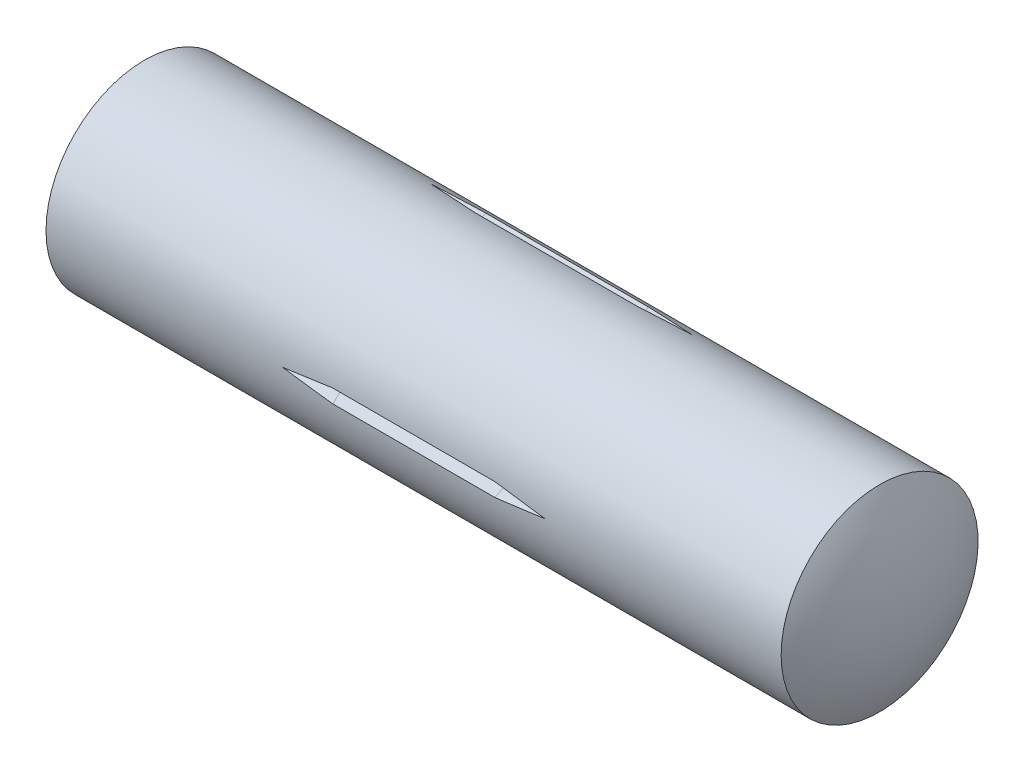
ISO-10303-21;
HEADER;
FILE_DESCRIPTION(('STEP AP214'),'2;1');
FILE_NAME('part.step','',(''),(''),'','','');
FILE_SCHEMA(('AUTOMOTIVE_DESIGN { 1 0 10303 214 1 1 1 1 }'));
ENDSEC;
DATA;
#1=APPLICATION_CONTEXT('core data for automotive mechanical design processes');
#2=APPLICATION_PROTOCOL_DEFINITION('international standard','automotive_design',2000,#1);
#3=PRODUCT_CONTEXT('',#1,'mechanical');
#4=PRODUCT('Part','Part','',(#3));
#5=PRODUCT_RELATED_PRODUCT_CATEGORY('part','',(#4));
#6=PRODUCT_DEFINITION_FORMATION('','',#4);
#7=PRODUCT_DEFINITION_CONTEXT('part definition',#1,'design');
#8=PRODUCT_DEFINITION('design','',#6,#7);
#9=PRODUCT_DEFINITION_SHAPE('','',#8);
#10=(LENGTH_UNIT() NAMED_UNIT(*) SI_UNIT(.MILLI.,.METRE.));
#11=(NAMED_UNIT(*) PLANE_ANGLE_UNIT() SI_UNIT($,.RADIAN.));
#12=(NAMED_UNIT(*) SI_UNIT($,.STERADIAN.) SOLID_ANGLE_UNIT());
#13=UNCERTAINTY_MEASURE_WITH_UNIT(LENGTH_MEASURE(1.E-05),#10,'distance_accuracy_value','');
#14=(GEOMETRIC_REPRESENTATION_CONTEXT(3) GLOBAL_UNCERTAINTY_ASSIGNED_CONTEXT((#13)) GLOBAL_UNIT_ASSIGNED_CONTEXT((#10,
#11,#12)) REPRESENTATION_CONTEXT('',''));
#15=CARTESIAN_POINT('',(0.,0.,0.));
#16=DIRECTION('',(0.,0.,1.));
#17=DIRECTION('',(1.,0.,0.));
#18=AXIS2_PLACEMENT_3D('',#15,#16,#17);
#19=CARTESIAN_POINT('',(-57.,0.,0.));
#20=DIRECTION('',(-1.,0.,0.));
#21=DIRECTION('',(0.,0.,1.));
#22=AXIS2_PLACEMENT_3D('',#19,#20,#21);
#23=CYLINDRICAL_SURFACE('',#22,12.5);
#24=CARTESIAN_POINT('',(-45.8333333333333,0.,0.));
#25=DIRECTION('',(-0.113967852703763,-0.0865878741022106,-0.989703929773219));
#26=DIRECTION('',(-0.993484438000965,0.00993295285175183,0.11353417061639));
#27=AXIS2_PLACEMENT_3D('',#24,#25,#26);
#28=ELLIPSE('',#27,109.68005190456,12.5);
#29=CARTESIAN_POINT('',(16.6666666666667,-10.8253175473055,-6.25000000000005));
#30=VERTEX_POINT('',#29);
#31=CARTESIAN_POINT('',(10.2959000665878,-11.2344625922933,-5.48058849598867));
#32=VERTEX_POINT('',#31);
#33=EDGE_CURVE('E230',#30,#32,#28,.T.);
#34=ORIENTED_EDGE('',*,*,#33,.F.);
#35=CARTESIAN_POINT('',(-45.8333333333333,0.,0.));
#36=DIRECTION('',(-0.113967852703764,-0.900402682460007,0.419864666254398));
#37=DIRECTION('',(-0.993484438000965,0.103289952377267,-0.0481648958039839));
#38=AXIS2_PLACEMENT_3D('',#35,#36,#37);
#39=ELLIPSE('',#38,109.68005190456,12.5);
#40=CARTESIAN_POINT('',(10.2959000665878,-10.3635601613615,-6.9890357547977));
#41=VERTEX_POINT('',#40);
#42=EDGE_CURVE('E228',#41,#30,#39,.T.);
#43=ORIENTED_EDGE('',*,*,#42,.F.);
#44=DIRECTION('',(-1.,0.,0.));
#45=VECTOR('',#44,1.);
#46=CARTESIAN_POINT('',(-57.,-10.3635601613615,-6.9890357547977));
#47=LINE('',#46,#45);
#48=CARTESIAN_POINT('',(-10.2959000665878,-10.3635601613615,-6.98903575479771));
#49=VERTEX_POINT('',#48);
#50=EDGE_CURVE('E222',#41,#49,#47,.T.);
#51=ORIENTED_EDGE('',*,*,#50,.T.);
#52=CARTESIAN_POINT('',(45.8333333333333,0.,0.));
#53=DIRECTION('',(0.113967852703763,-0.900402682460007,0.419864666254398));
#54=DIRECTION('',(-0.993484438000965,-0.103289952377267,0.0481648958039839));
#55=AXIS2_PLACEMENT_3D('',#52,#53,#54);
#56=ELLIPSE('',#55,109.68005190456,12.5);
#57=CARTESIAN_POINT('',(-16.6666666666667,-10.8253175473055,-6.25000000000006));
#58=VERTEX_POINT('',#57);
#59=EDGE_CURVE('E218',#58,#49,#56,.T.);
#60=ORIENTED_EDGE('',*,*,#59,.F.);
#61=CARTESIAN_POINT('',(45.8333333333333,0.,0.));
#62=DIRECTION('',(0.113967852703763,-0.0865878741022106,-0.989703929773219));
#63=DIRECTION('',(-0.993484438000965,-0.00993295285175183,-0.11353417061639));
#64=AXIS2_PLACEMENT_3D('',#61,#62,#63);
#65=ELLIPSE('',#64,109.68005190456,12.5);
#66=CARTESIAN_POINT('',(-10.2959000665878,-11.2344625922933,-5.48058849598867));
#67=VERTEX_POINT('',#66);
#68=EDGE_CURVE('E220',#67,#58,#65,.T.);
#69=ORIENTED_EDGE('',*,*,#68,.F.);
#70=DIRECTION('',(-1.,0.,0.));
#71=VECTOR('',#70,1.);
#72=CARTESIAN_POINT('',(-57.,-11.2344625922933,-5.48058849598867));
#73=LINE('',#72,#71);
#74=EDGE_CURVE('E225',#67,#32,#73,.F.);
#75=ORIENTED_EDGE('',*,*,#74,.T.);
#76=EDGE_LOOP('',(#34,#43,#51,#60,#69,#75));
#77=FACE_BOUND('',#76,.T.);
#78=CARTESIAN_POINT('',(46.6506350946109,0.,0.));
#79=DIRECTION('',(-1.,0.,0.));
#80=DIRECTION('',(0.,0.,1.));
#81=AXIS2_PLACEMENT_3D('',#78,#79,#80);
#82=CIRCLE('',#81,12.5);
#83=CARTESIAN_POINT('',(46.6506350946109,0.,12.5));
#84=VERTEX_POINT('',#83);
#85=EDGE_CURVE('E197',#84,#84,#82,.T.);
#86=ORIENTED_EDGE('',*,*,#85,.T.);
#87=EDGE_LOOP('',(#86));
#88=FACE_BOUND('',#87,.T.);
#89=CARTESIAN_POINT('',(-46.6819046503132,0.,0.));
#90=DIRECTION('',(-1.,0.,0.));
#91=DIRECTION('',(0.,0.,1.));
#92=AXIS2_PLACEMENT_3D('',#89,#90,#91);
#93=CIRCLE('',#92,12.5);
#94=CARTESIAN_POINT('',(-46.6819046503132,12.5,0.));
#95=VERTEX_POINT('',#94);
#96=EDGE_CURVE('E194',#95,#95,#93,.T.);
#97=ORIENTED_EDGE('',*,*,#96,.F.);
#98=EDGE_LOOP('',(#97));
#99=FACE_BOUND('',#98,.T.);
#100=CARTESIAN_POINT('',(-45.8333333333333,0.,0.));
#101=DIRECTION('',(-0.113967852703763,-0.81381480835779,0.569839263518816));
#102=DIRECTION('',(-0.993484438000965,0.0933569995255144,-0.0653692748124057));
#103=AXIS2_PLACEMENT_3D('',#100,#101,#102);
#104=ELLIPSE('',#103,109.68005190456,12.5);
#105=CARTESIAN_POINT('',(16.6666666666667,0.,12.5));
#106=VERTEX_POINT('',#105);
#107=CARTESIAN_POINT('',(10.2959000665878,0.870902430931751,12.4696242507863));
#108=VERTEX_POINT('',#107);
#109=EDGE_CURVE('E216',#106,#108,#104,.T.);
#110=ORIENTED_EDGE('',*,*,#109,.F.);
#111=CARTESIAN_POINT('',(-45.8333333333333,0.,0.));
#112=DIRECTION('',(-0.113967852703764,0.813814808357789,0.569839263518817));
#113=DIRECTION('',(-0.993484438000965,-0.0933569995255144,-0.0653692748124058));
#114=AXIS2_PLACEMENT_3D('',#111,#112,#113);
#115=ELLIPSE('',#114,109.68005190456,12.5);
#116=CARTESIAN_POINT('',(10.2959000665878,-0.870902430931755,12.4696242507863));
#117=VERTEX_POINT('',#116);
#118=EDGE_CURVE('E214',#117,#106,#115,.T.);
#119=ORIENTED_EDGE('',*,*,#118,.F.);
#120=DIRECTION('',(-1.,0.,0.));
#121=VECTOR('',#120,1.);
#122=CARTESIAN_POINT('',(-57.,-0.870902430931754,12.4696242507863));
#123=LINE('',#122,#121);
#124=CARTESIAN_POINT('',(-10.2959000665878,-0.870902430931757,12.4696242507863));
#125=VERTEX_POINT('',#124);
#126=EDGE_CURVE('E208',#117,#125,#123,.T.);
#127=ORIENTED_EDGE('',*,*,#126,.T.);
#128=CARTESIAN_POINT('',(45.8333333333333,0.,0.));
#129=DIRECTION('',(0.113967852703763,0.813814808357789,0.569839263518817));
#130=DIRECTION('',(-0.993484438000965,0.0933569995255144,0.0653692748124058));
#131=AXIS2_PLACEMENT_3D('',#128,#129,#130);
#132=ELLIPSE('',#131,109.68005190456,12.5);
#133=CARTESIAN_POINT('',(-16.6666666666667,0.,12.5));
#134=VERTEX_POINT('',#133);
#135=EDGE_CURVE('E203',#134,#125,#132,.T.);
#136=ORIENTED_EDGE('',*,*,#135,.F.);
#137=CARTESIAN_POINT('',(45.8333333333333,0.,0.));
#138=DIRECTION('',(0.113967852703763,-0.81381480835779,0.569839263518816));
#139=DIRECTION('',(-0.993484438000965,-0.0933569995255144,0.0653692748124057));
#140=AXIS2_PLACEMENT_3D('',#137,#138,#139);
#141=ELLIPSE('',#140,109.68005190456,12.5);
#142=CARTESIAN_POINT('',(-10.2959000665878,0.870902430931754,12.4696242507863));
#143=VERTEX_POINT('',#142);
#144=EDGE_CURVE('E205',#143,#134,#141,.T.);
#145=ORIENTED_EDGE('',*,*,#144,.F.);
#146=DIRECTION('',(-1.,0.,0.));
#147=VECTOR('',#146,1.);
#148=CARTESIAN_POINT('',(-57.,0.87090243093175,12.4696242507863));
#149=LINE('',#148,#147);
#150=EDGE_CURVE('E211',#143,#108,#149,.F.);
#151=ORIENTED_EDGE('',*,*,#150,.T.);
#152=EDGE_LOOP('',(#110,#119,#127,#136,#145,#151));
#153=FACE_BOUND('',#152,.T.);
#154=CARTESIAN_POINT('',(-45.8333333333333,0.,0.));
#155=DIRECTION('',(-0.113967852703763,0.900402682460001,0.419864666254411));
#156=DIRECTION('',(-0.993484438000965,-0.103289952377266,-0.0481648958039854));
#157=AXIS2_PLACEMENT_3D('',#154,#155,#156);
#158=ELLIPSE('',#157,109.68005190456,12.5);
#159=CARTESIAN_POINT('',(16.6666666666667,10.8253175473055,-6.2499999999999));
#160=VERTEX_POINT('',#159);
#161=CARTESIAN_POINT('',(10.2959000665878,10.3635601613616,-6.98903575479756));
#162=VERTEX_POINT('',#161);
#163=EDGE_CURVE('E12',#160,#162,#158,.T.);
#164=ORIENTED_EDGE('',*,*,#163,.F.);
#165=CARTESIAN_POINT('',(-45.8333333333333,0.,0.));
#166=DIRECTION('',(-0.113967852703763,0.086587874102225,-0.989703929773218));
#167=DIRECTION('',(-0.993484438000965,-0.00993295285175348,0.11353417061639));
#168=AXIS2_PLACEMENT_3D('',#165,#166,#167);
#169=ELLIPSE('',#168,109.68005190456,12.5);
#170=CARTESIAN_POINT('',(10.2959000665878,11.2344625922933,-5.48058849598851));
#171=VERTEX_POINT('',#170);
#172=EDGE_CURVE('E46',#171,#160,#169,.T.);
#173=ORIENTED_EDGE('',*,*,#172,.F.);
#174=DIRECTION('',(-1.,0.,0.));
#175=VECTOR('',#174,1.);
#176=CARTESIAN_POINT('',(-57.,11.2344625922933,-5.48058849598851));
#177=LINE('',#176,#175);
#178=CARTESIAN_POINT('',(-10.2959000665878,11.2344625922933,-5.48058849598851));
#179=VERTEX_POINT('',#178);
#180=EDGE_CURVE('E234',#171,#179,#177,.T.);
#181=ORIENTED_EDGE('',*,*,#180,.T.);
#182=CARTESIAN_POINT('',(45.8333333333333,0.,0.));
#183=DIRECTION('',(0.113967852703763,0.086587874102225,-0.989703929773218));
#184=DIRECTION('',(-0.993484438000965,0.00993295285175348,-0.11353417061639));
#185=AXIS2_PLACEMENT_3D('',#182,#183,#184);
#186=ELLIPSE('',#185,109.68005190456,12.5);
#187=CARTESIAN_POINT('',(-16.6666666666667,10.8253175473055,-6.2499999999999));
#188=VERTEX_POINT('',#187);
#189=EDGE_CURVE('E128',#188,#179,#186,.T.);
#190=ORIENTED_EDGE('',*,*,#189,.F.);
#191=CARTESIAN_POINT('',(45.8333333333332,0.,0.));
#192=DIRECTION('',(0.113967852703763,0.900402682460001,0.419864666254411));
#193=DIRECTION('',(-0.993484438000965,0.103289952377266,0.0481648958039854));
#194=AXIS2_PLACEMENT_3D('',#191,#192,#193);
#195=ELLIPSE('',#194,109.68005190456,12.5);
#196=CARTESIAN_POINT('',(-10.2959000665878,10.3635601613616,-6.98903575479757));
#197=VERTEX_POINT('',#196);
#198=EDGE_CURVE('E152',#197,#188,#195,.T.);
#199=ORIENTED_EDGE('',*,*,#198,.F.);
#200=DIRECTION('',(-1.,0.,0.));
#201=VECTOR('',#200,1.);
#202=CARTESIAN_POINT('',(-57.,10.3635601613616,-6.98903575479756));
#203=LINE('',#202,#201);
#204=EDGE_CURVE('E147',#197,#162,#203,.F.);
#205=ORIENTED_EDGE('',*,*,#204,.T.);
#206=EDGE_LOOP('',(#164,#173,#181,#190,#199,#205));
#207=FACE_BOUND('',#206,.T.);
#208=ADVANCED_FACE('F38',(#77,#88,#99,#153,#207),#23,.T.);
#209=CARTESIAN_POINT('',(-25.0312695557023,0.,0.));
#210=DIRECTION('',(-1.,0.,0.));
#211=DIRECTION('',(0.,1.,0.));
#212=AXIS2_PLACEMENT_3D('',#209,#210,#211);
#213=SPHERICAL_SURFACE('',#212,25.);
#214=CARTESIAN_POINT('',(-50.,0.,0.));
#215=DIRECTION('',(-1.,0.,0.));
#216=DIRECTION('',(0.,0.,1.));
#217=AXIS2_PLACEMENT_3D('',#214,#215,#216);
#218=CIRCLE('',#217,1.25);
#219=CARTESIAN_POINT('',(-50.,1.25000000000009,0.));
#220=VERTEX_POINT('',#219);
#221=EDGE_CURVE('E200',#220,#220,#218,.T.);
#222=CARTESIAN_POINT('',(-50.,1.25000000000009,0.));
#223=CARTESIAN_POINT('',(-49.9938336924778,1.37317333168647,0.));
#224=CARTESIAN_POINT('',(-49.9867558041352,1.49630102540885,0.));
#225=CARTESIAN_POINT('',(-49.9707787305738,1.74243819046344,0.));
#226=CARTESIAN_POINT('',(-49.9618795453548,1.86544766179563,0.));
#227=CARTESIAN_POINT('',(-49.942261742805,2.11132143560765,0.));
#228=CARTESIAN_POINT('',(-49.931543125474,2.23418573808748,0.));
#229=CARTESIAN_POINT('',(-49.9082888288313,2.47974226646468,0.));
#230=CARTESIAN_POINT('',(-49.8957531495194,2.60243449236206,0.));
#231=CARTESIAN_POINT('',(-49.8688674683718,2.84761999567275,0.));
#232=CARTESIAN_POINT('',(-49.854517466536,2.97011327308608,0.));
#233=CARTESIAN_POINT('',(-49.8240062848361,3.21487405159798,0.));
#234=CARTESIAN_POINT('',(-49.8078451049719,3.33714155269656,0.));
#235=CARTESIAN_POINT('',(-49.7737151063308,3.58142400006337,0.));
#236=CARTESIAN_POINT('',(-49.7557462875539,3.70343894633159,0.));
#237=CARTESIAN_POINT('',(-49.718004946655,3.94718956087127,0.));
#238=CARTESIAN_POINT('',(-49.698232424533,4.06892522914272,0.));
#239=CARTESIAN_POINT('',(-49.6568880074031,4.31209062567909,0.));
#240=CARTESIAN_POINT('',(-49.6353161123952,4.433520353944,0.));
#241=CARTESIAN_POINT('',(-49.5903776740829,4.67604727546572,0.));
#242=CARTESIAN_POINT('',(-49.5670111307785,4.79714446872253,0.));
#243=CARTESIAN_POINT('',(-49.5184885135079,5.03897979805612,0.));
#244=CARTESIAN_POINT('',(-49.4933324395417,5.15971793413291,0.));
#245=CARTESIAN_POINT('',(-49.4412362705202,5.40080870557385,0.));
#246=CARTESIAN_POINT('',(-49.414296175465,5.521161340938,0.));
#247=CARTESIAN_POINT('',(-49.3586378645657,5.76145475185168,0.));
#248=CARTESIAN_POINT('',(-49.3299196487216,5.8813955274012,0.));
#249=CARTESIAN_POINT('',(-49.2707113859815,6.12083894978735,0.));
#250=CARTESIAN_POINT('',(-49.2402213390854,6.24034159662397,0.));
#251=CARTESIAN_POINT('',(-49.1774760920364,6.47888258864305,0.));
#252=CARTESIAN_POINT('',(-49.1452208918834,6.59792093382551,0.));
#253=CARTESIAN_POINT('',(-49.078952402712,6.83550725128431,0.));
#254=CARTESIAN_POINT('',(-49.0449391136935,6.95405522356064,0.));
#255=CARTESIAN_POINT('',(-48.9751618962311,7.19063483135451,0.));
#256=CARTESIAN_POINT('',(-48.9393979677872,7.30866646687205,0.));
#257=CARTESIAN_POINT('',(-48.8661273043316,7.54418755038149,0.));
#258=CARTESIAN_POINT('',(-48.8286205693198,7.66167699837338,0.));
#259=CARTESIAN_POINT('',(-48.7518725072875,7.89608797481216,0.));
#260=CARTESIAN_POINT('',(-48.712631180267,8.01300950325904,0.));
#261=CARTESIAN_POINT('',(-48.6324225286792,8.24625903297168,0.));
#262=CARTESIAN_POINT('',(-48.5914552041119,8.36258703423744,0.));
#263=CARTESIAN_POINT('',(-48.5078035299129,8.59462403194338,0.));
#264=CARTESIAN_POINT('',(-48.4651191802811,8.71033302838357,0.));
#265=CARTESIAN_POINT('',(-48.3780428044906,8.94110667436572,0.));
#266=CARTESIAN_POINT('',(-48.3336507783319,9.05617132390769,0.));
#267=CARTESIAN_POINT('',(-48.2431687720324,9.28563107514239,0.));
#268=CARTESIAN_POINT('',(-48.1970787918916,9.40002617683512,0.));
#269=CARTESIAN_POINT('',(-48.1032109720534,9.62812177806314,0.));
#270=CARTESIAN_POINT('',(-48.055433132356,9.74182227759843,0.));
#271=CARTESIAN_POINT('',(-47.9582000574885,9.96850377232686,0.));
#272=CARTESIAN_POINT('',(-47.9087448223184,10.08148476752,0.));
#273=CARTESIAN_POINT('',(-47.8081677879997,10.3067025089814,0.));
#274=CARTESIAN_POINT('',(-47.7570459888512,10.4189392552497,0.));
#275=CARTESIAN_POINT('',(-47.653147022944,10.6426439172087,0.));
#276=CARTESIAN_POINT('',(-47.6003698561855,10.7541118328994,0.));
#277=CARTESIAN_POINT('',(-47.4931717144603,10.9762544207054,0.));
#278=CARTESIAN_POINT('',(-47.4387507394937,11.0869290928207,0.));
#279=CARTESIAN_POINT('',(-47.3282768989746,11.307460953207,0.));
#280=CARTESIAN_POINT('',(-47.272224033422,11.417318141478,0.));
#281=CARTESIAN_POINT('',(-47.1584986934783,11.6361909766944,0.));
#282=CARTESIAN_POINT('',(-47.1008262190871,11.7452066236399,0.));
#283=CARTESIAN_POINT('',(-46.9838742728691,11.9623724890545,0.));
#284=CARTESIAN_POINT('',(-46.9245948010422,12.0705227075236,0.));
#285=CARTESIAN_POINT('',(-46.8044419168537,12.2859340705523,0.));
#286=CARTESIAN_POINT('',(-46.743568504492,12.3931952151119,0.));
#287=CARTESIAN_POINT('',(-46.6819046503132,12.5,0.));
#288=B_SPLINE_CURVE_WITH_KNOTS('',3,(#222,#223,#224,#225,#226,#227,#228,#229,#230,#231,#232,
#233,#234,#235,#236,#237,#238,#239,#240,#241,#242,#243,#244,#245,#246,#247,#248,#249,#250,#251,
#252,#253,#254,#255,#256,#257,#258,#259,#260,#261,#262,#263,#264,#265,#266,#267,#268,#269,#270,
#271,#272,#273,#274,#275,#276,#277,#278,#279,#280,#281,#282,#283,#284,#285,#286,#287),
.UNSPECIFIED.,.F.,.F.,(4,2,2,2,2,2,2,2,2,2,2,2,2,2,2,2,2,2,2,2,2,2,2,2,2,2,2,2,2,2,2,2,4),(0.,
0.369979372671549,0.739958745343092,1.10993811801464,1.47991749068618,1.84989686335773,
2.21987623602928,2.58985560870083,2.95983498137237,3.32981435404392,3.69979372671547,
4.06977309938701,4.43975247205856,4.8097318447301,5.17971121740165,5.5496905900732,
5.91966996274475,6.28964933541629,6.65962870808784,7.02960808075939,7.39958745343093,
7.76956682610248,8.13954619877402,8.50952557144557,8.87950494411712,9.24948431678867,
9.61946368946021,9.98944306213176,10.3594224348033,10.7294018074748,11.0993811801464,
11.4693605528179,11.8393399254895),.UNSPECIFIED.);
#289=EDGE_CURVE('BSEAM40',#220,#95,#288,.T.);
#290=ORIENTED_EDGE('',*,*,#221,.F.);
#291=ORIENTED_EDGE('',*,*,#96,.T.);
#292=ORIENTED_EDGE('',*,*,#289,.T.);
#293=ORIENTED_EDGE('',*,*,#289,.F.);
#294=EDGE_LOOP('',(#290,#292,#291,#293));
#295=FACE_BOUND('',#294,.T.);
#296=ADVANCED_FACE('F40',(#295),#213,.T.);
#297=CARTESIAN_POINT('',(-50.,0.,0.));
#298=DIRECTION('',(1.,0.,0.));
#299=DIRECTION('',(0.,0.,-1.));
#300=AXIS2_PLACEMENT_3D('',#297,#298,#299);
#301=PLANE('',#300);
#302=ORIENTED_EDGE('',*,*,#221,.T.);
#303=EDGE_LOOP('',(#302));
#304=FACE_BOUND('',#303,.T.);
#305=ADVANCED_FACE('F250',(#304),#301,.F.);
#306=CARTESIAN_POINT('',(25.,0.,0.));
#307=DIRECTION('',(-1.,0.,0.));
#308=DIRECTION('',(0.,1.,0.));
#309=AXIS2_PLACEMENT_3D('',#306,#307,#308);
#310=SPHERICAL_SURFACE('',#309,25.);
#311=ORIENTED_EDGE('',*,*,#85,.F.);
#312=EDGE_LOOP('',(#311));
#313=FACE_BOUND('',#312,.T.);
#314=ADVANCED_FACE('F258',(#313),#310,.T.);
#315=CARTESIAN_POINT('',(10.3034311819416,0.81659216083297,12.3935673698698));
#316=DIRECTION('',(-0.113967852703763,-0.81381480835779,0.569839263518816));
#317=DIRECTION('',(0.,-0.573576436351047,-0.819152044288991));
#318=AXIS2_PLACEMENT_3D('',#315,#316,#317);
#319=PLANE('',#318);
#320=ORIENTED_EDGE('',*,*,#109,.T.);
#321=DIRECTION('',(0.0803231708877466,-0.579246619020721,-0.811185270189));
#322=VECTOR('',#321,1.);
#323=CARTESIAN_POINT('',(10.3034311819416,0.81659216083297,12.3935673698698));
#324=LINE('',#323,#322);
#325=CARTESIAN_POINT('',(10.4166666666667,0.,11.25));
#326=VERTEX_POINT('',#325);
#327=EDGE_CURVE('E181',#108,#326,#324,.T.);
#328=ORIENTED_EDGE('',*,*,#327,.T.);
#329=DIRECTION('',(0.98058067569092,0.,0.196116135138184));
#330=VECTOR('',#329,1.);
#331=CARTESIAN_POINT('',(10.4166666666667,0.,11.25));
#332=LINE('',#331,#330);
#333=EDGE_CURVE('E180',#326,#106,#332,.T.);
#334=ORIENTED_EDGE('',*,*,#333,.T.);
#335=EDGE_LOOP('',(#320,#328,#334));
#336=FACE_BOUND('',#335,.T.);
#337=ADVANCED_FACE('F260',(#336),#319,.T.);
#338=CARTESIAN_POINT('',(10.3034311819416,-0.816592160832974,12.3935673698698));
#339=DIRECTION('',(-0.113967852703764,0.813814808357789,0.569839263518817));
#340=DIRECTION('',(0.,-0.573576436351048,0.819152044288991));
#341=AXIS2_PLACEMENT_3D('',#338,#339,#340);
#342=PLANE('',#341);
#343=ORIENTED_EDGE('',*,*,#118,.T.);
#344=ORIENTED_EDGE('',*,*,#333,.F.);
#345=DIRECTION('',(-0.0803231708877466,-0.579246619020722,0.811185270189));
#346=VECTOR('',#345,1.);
#347=CARTESIAN_POINT('',(10.3034311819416,-0.816592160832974,12.3935673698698));
#348=LINE('',#347,#346);
#349=EDGE_CURVE('E177',#326,#117,#348,.T.);
#350=ORIENTED_EDGE('',*,*,#349,.T.);
#351=EDGE_LOOP('',(#343,#344,#350));
#352=FACE_BOUND('',#351,.T.);
#353=ADVANCED_FACE('F256',(#352),#342,.T.);
#354=CARTESIAN_POINT('',(-10.4381207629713,-0.154715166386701,11.033334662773));
#355=DIRECTION('',(0.,0.81381480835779,-0.581124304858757));
#356=DIRECTION('',(0.,0.581124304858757,0.81381480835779));
#357=AXIS2_PLACEMENT_3D('',#354,#355,#356);
#358=PLANE('',#357);
#359=DIRECTION('',(0.0803231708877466,0.579246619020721,0.811185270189));
#360=VECTOR('',#359,1.);
#361=CARTESIAN_POINT('',(-10.4381207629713,-0.154715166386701,11.033334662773));
#362=LINE('',#361,#360);
#363=CARTESIAN_POINT('',(-10.4166666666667,0.,11.25));
#364=VERTEX_POINT('',#363);
#365=EDGE_CURVE('E184',#364,#143,#362,.T.);
#366=ORIENTED_EDGE('',*,*,#365,.F.);
#367=DIRECTION('',(1.,0.,0.));
#368=VECTOR('',#367,1.);
#369=CARTESIAN_POINT('',(-10.4166666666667,0.,11.25));
#370=LINE('',#369,#368);
#371=EDGE_CURVE('E183',#364,#326,#370,.T.);
#372=ORIENTED_EDGE('',*,*,#371,.T.);
#373=ORIENTED_EDGE('',*,*,#327,.F.);
#374=ORIENTED_EDGE('',*,*,#150,.F.);
#375=EDGE_LOOP('',(#366,#372,#373,#374));
#376=FACE_BOUND('',#375,.T.);
#377=ADVANCED_FACE('F279',(#376),#358,.F.);
#378=CARTESIAN_POINT('',(-10.4381207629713,0.154715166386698,11.033334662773));
#379=DIRECTION('',(0.,-0.813814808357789,-0.581124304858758));
#380=DIRECTION('',(0.,0.581124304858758,-0.81381480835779));
#381=AXIS2_PLACEMENT_3D('',#378,#379,#380);
#382=PLANE('',#381);
#383=ORIENTED_EDGE('',*,*,#349,.F.);
#384=ORIENTED_EDGE('',*,*,#371,.F.);
#385=DIRECTION('',(-0.0803231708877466,0.579246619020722,-0.811185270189));
#386=VECTOR('',#385,1.);
#387=CARTESIAN_POINT('',(-10.4381207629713,0.154715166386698,11.033334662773));
#388=LINE('',#387,#386);
#389=EDGE_CURVE('E187',#125,#364,#388,.T.);
#390=ORIENTED_EDGE('',*,*,#389,.F.);
#391=ORIENTED_EDGE('',*,*,#126,.F.);
#392=EDGE_LOOP('',(#383,#384,#390,#391));
#393=FACE_BOUND('',#392,.T.);
#394=ADVANCED_FACE('F285',(#393),#382,.F.);
#395=CARTESIAN_POINT('',(-7.15595898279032,0.,10.5978584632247));
#396=DIRECTION('',(0.113967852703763,-0.81381480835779,0.569839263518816));
#397=DIRECTION('',(0.,-0.573576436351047,-0.819152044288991));
#398=AXIS2_PLACEMENT_3D('',#395,#396,#397);
#399=PLANE('',#398);
#400=ORIENTED_EDGE('',*,*,#144,.T.);
#401=DIRECTION('',(-0.98058067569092,0.,0.196116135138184));
#402=VECTOR('',#401,1.);
#403=CARTESIAN_POINT('',(-7.15595898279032,0.,10.5978584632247));
#404=LINE('',#403,#402);
#405=EDGE_CURVE('E176',#364,#134,#404,.T.);
#406=ORIENTED_EDGE('',*,*,#405,.F.);
#407=ORIENTED_EDGE('',*,*,#365,.T.);
#408=EDGE_LOOP('',(#400,#406,#407));
#409=FACE_BOUND('',#408,.T.);
#410=ADVANCED_FACE('F297',(#409),#399,.T.);
#411=CARTESIAN_POINT('',(-7.15595898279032,0.,10.5978584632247));
#412=DIRECTION('',(0.113967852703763,0.813814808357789,0.569839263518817));
#413=DIRECTION('',(0.,-0.573576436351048,0.819152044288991));
#414=AXIS2_PLACEMENT_3D('',#411,#412,#413);
#415=PLANE('',#414);
#416=ORIENTED_EDGE('',*,*,#135,.T.);
#417=ORIENTED_EDGE('',*,*,#389,.T.);
#418=ORIENTED_EDGE('',*,*,#405,.T.);
#419=EDGE_LOOP('',(#416,#417,#418));
#420=FACE_BOUND('',#419,.T.);
#421=ADVANCED_FACE('F299',(#420),#415,.T.);
#422=CARTESIAN_POINT('',(10.3037194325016,-11.137879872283,-5.48993881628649));
#423=DIRECTION('',(-0.113967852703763,-0.0865878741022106,-0.989703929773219));
#424=DIRECTION('',(-0.993435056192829,0.,0.114397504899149));
#425=AXIS2_PLACEMENT_3D('',#422,#423,#424);
#426=PLANE('',#425);
#427=ORIENTED_EDGE('',*,*,#33,.T.);
#428=DIRECTION('',(0.0803231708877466,0.992130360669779,-0.0960496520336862));
#429=VECTOR('',#428,1.);
#430=CARTESIAN_POINT('',(10.3037194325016,-11.137879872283,-5.48993881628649));
#431=LINE('',#430,#429);
#432=CARTESIAN_POINT('',(10.4166666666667,-9.74278579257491,-5.62500000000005));
#433=VERTEX_POINT('',#432);
#434=EDGE_CURVE('E163',#32,#433,#431,.T.);
#435=ORIENTED_EDGE('',*,*,#434,.T.);
#436=DIRECTION('',(0.98058067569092,-0.169841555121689,-0.0980580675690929));
#437=VECTOR('',#436,1.);
#438=CARTESIAN_POINT('',(10.4166666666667,-9.74278579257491,-5.62500000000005));
#439=LINE('',#438,#437);
#440=EDGE_CURVE('E162',#433,#30,#439,.T.);
#441=ORIENTED_EDGE('',*,*,#440,.T.);
#442=EDGE_LOOP('',(#427,#435,#441));
#443=FACE_BOUND('',#442,.T.);
#444=ADVANCED_FACE('F302',(#443),#426,.T.);
#445=CARTESIAN_POINT('',(10.3037194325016,-10.3233664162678,-6.90071750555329));
#446=DIRECTION('',(-0.113967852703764,-0.900402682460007,0.419864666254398));
#447=DIRECTION('',(0.,-0.422618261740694,-0.906307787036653));
#448=AXIS2_PLACEMENT_3D('',#445,#446,#447);
#449=PLANE('',#448);
#450=ORIENTED_EDGE('',*,*,#42,.T.);
#451=ORIENTED_EDGE('',*,*,#440,.F.);
#452=DIRECTION('',(-0.0803231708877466,-0.412883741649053,-0.907234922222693));
#453=VECTOR('',#452,1.);
#454=CARTESIAN_POINT('',(10.3037194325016,-10.3233664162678,-6.90071750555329));
#455=LINE('',#454,#453);
#456=EDGE_CURVE('E159',#433,#41,#455,.T.);
#457=ORIENTED_EDGE('',*,*,#456,.T.);
#458=EDGE_LOOP('',(#450,#451,#457));
#459=FACE_BOUND('',#458,.T.);
#460=ADVANCED_FACE('F307',(#459),#449,.T.);
#461=CARTESIAN_POINT('',(-10.4384127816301,-9.47418358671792,-5.65100378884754));
#462=DIRECTION('',(0.,0.0963610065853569,0.99534645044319));
#463=DIRECTION('',(0.,-0.99534645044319,0.0963610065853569));
#464=AXIS2_PLACEMENT_3D('',#461,#462,#463);
#465=PLANE('',#464);
#466=DIRECTION('',(0.0803231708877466,-0.992130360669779,0.0960496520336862));
#467=VECTOR('',#466,1.);
#468=CARTESIAN_POINT('',(-10.4384127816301,-9.47418358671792,-5.65100378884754));
#469=LINE('',#468,#467);
#470=CARTESIAN_POINT('',(-10.4166666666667,-9.74278579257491,-5.62500000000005));
#471=VERTEX_POINT('',#470);
#472=EDGE_CURVE('E166',#471,#67,#469,.T.);
#473=ORIENTED_EDGE('',*,*,#472,.F.);
#474=DIRECTION('',(1.,0.,0.));
#475=VECTOR('',#474,1.);
#476=CARTESIAN_POINT('',(-10.4166666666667,-9.74278579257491,-5.62500000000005));
#477=LINE('',#476,#475);
#478=EDGE_CURVE('E165',#471,#433,#477,.T.);
#479=ORIENTED_EDGE('',*,*,#478,.T.);
#480=ORIENTED_EDGE('',*,*,#434,.F.);
#481=ORIENTED_EDGE('',*,*,#74,.F.);
#482=EDGE_LOOP('',(#473,#479,#480,#481));
#483=FACE_BOUND('',#482,.T.);
#484=ADVANCED_FACE('F310',(#483),#465,.F.);
#485=CARTESIAN_POINT('',(-10.4384127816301,-9.63100463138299,-5.37938177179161));
#486=DIRECTION('',(0.,0.910175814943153,-0.414222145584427));
#487=DIRECTION('',(0.,0.414222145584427,0.910175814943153));
#488=AXIS2_PLACEMENT_3D('',#485,#486,#487);
#489=PLANE('',#488);
#490=ORIENTED_EDGE('',*,*,#456,.F.);
#491=ORIENTED_EDGE('',*,*,#478,.F.);
#492=DIRECTION('',(-0.0803231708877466,0.412883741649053,0.907234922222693));
#493=VECTOR('',#492,1.);
#494=CARTESIAN_POINT('',(-10.4384127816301,-9.63100463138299,-5.37938177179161));
#495=LINE('',#494,#493);
#496=EDGE_CURVE('E169',#49,#471,#495,.T.);
#497=ORIENTED_EDGE('',*,*,#496,.F.);
#498=ORIENTED_EDGE('',*,*,#50,.F.);
#499=EDGE_LOOP('',(#490,#491,#497,#498));
#500=FACE_BOUND('',#499,.T.);
#501=ADVANCED_FACE('F315',(#500),#489,.F.);
#502=CARTESIAN_POINT('',(-7.11157643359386,-9.17032737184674,-5.29449097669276));
#503=DIRECTION('',(0.113967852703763,-0.0865878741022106,-0.989703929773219));
#504=DIRECTION('',(-0.993435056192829,0.,-0.114397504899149));
#505=AXIS2_PLACEMENT_3D('',#502,#503,#504);
#506=PLANE('',#505);
#507=ORIENTED_EDGE('',*,*,#68,.T.);
#508=DIRECTION('',(-0.98058067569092,-0.169841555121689,-0.0980580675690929));
#509=VECTOR('',#508,1.);
#510=CARTESIAN_POINT('',(-7.11157643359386,-9.17032737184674,-5.29449097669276));
#511=LINE('',#510,#509);
#512=EDGE_CURVE('E61',#471,#58,#511,.T.);
#513=ORIENTED_EDGE('',*,*,#512,.F.);
#514=ORIENTED_EDGE('',*,*,#472,.T.);
#515=EDGE_LOOP('',(#507,#513,#514));
#516=FACE_BOUND('',#515,.T.);
#517=ADVANCED_FACE('F318',(#516),#506,.T.);
#518=CARTESIAN_POINT('',(-7.11157643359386,-9.17032737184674,-5.29449097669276));
#519=DIRECTION('',(0.113967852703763,-0.900402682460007,0.419864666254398));
#520=DIRECTION('',(0.,-0.422618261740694,-0.906307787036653));
#521=AXIS2_PLACEMENT_3D('',#518,#519,#520);
#522=PLANE('',#521);
#523=ORIENTED_EDGE('',*,*,#59,.T.);
#524=ORIENTED_EDGE('',*,*,#496,.T.);
#525=ORIENTED_EDGE('',*,*,#512,.T.);
#526=EDGE_LOOP('',(#523,#524,#525));
#527=FACE_BOUND('',#526,.T.);
#528=ADVANCED_FACE('F323',(#527),#522,.T.);
#529=CARTESIAN_POINT('',(10.3037194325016,10.3233664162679,-6.90071750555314));
#530=DIRECTION('',(-0.113967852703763,0.900402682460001,0.419864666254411));
#531=DIRECTION('',(0.,-0.422618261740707,0.906307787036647));
#532=AXIS2_PLACEMENT_3D('',#529,#530,#531);
#533=PLANE('',#532);
#534=ORIENTED_EDGE('',*,*,#163,.T.);
#535=DIRECTION('',(0.0803231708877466,-0.412883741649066,0.907234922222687));
#536=VECTOR('',#535,1.);
#537=CARTESIAN_POINT('',(10.3037194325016,10.3233664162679,-6.90071750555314));
#538=LINE('',#537,#536);
#539=CARTESIAN_POINT('',(10.4166666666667,9.74278579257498,-5.62499999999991));
#540=VERTEX_POINT('',#539);
#541=EDGE_CURVE('E142',#162,#540,#538,.T.);
#542=ORIENTED_EDGE('',*,*,#541,.T.);
#543=DIRECTION('',(0.98058067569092,0.16984155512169,-0.0980580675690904));
#544=VECTOR('',#543,1.);
#545=CARTESIAN_POINT('',(10.4166666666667,9.74278579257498,-5.62499999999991));
#546=LINE('',#545,#544);
#547=EDGE_CURVE('E156',#540,#160,#546,.T.);
#548=ORIENTED_EDGE('',*,*,#547,.T.);
#549=EDGE_LOOP('',(#534,#542,#548));
#550=FACE_BOUND('',#549,.T.);
#551=ADVANCED_FACE('F243',(#550),#533,.T.);
#552=CARTESIAN_POINT('',(10.3037194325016,11.137879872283,-5.48993881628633));
#553=DIRECTION('',(-0.113967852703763,0.086587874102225,-0.989703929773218));
#554=DIRECTION('',(-0.993435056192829,0.,0.11439750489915));
#555=AXIS2_PLACEMENT_3D('',#552,#553,#554);
#556=PLANE('',#555);
#557=ORIENTED_EDGE('',*,*,#172,.T.);
#558=ORIENTED_EDGE('',*,*,#547,.F.);
#559=DIRECTION('',(-0.0803231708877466,0.992130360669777,0.0960496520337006));
#560=VECTOR('',#559,1.);
#561=CARTESIAN_POINT('',(10.3037194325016,11.137879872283,-5.48993881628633));
#562=LINE('',#561,#560);
#563=EDGE_CURVE('E139',#540,#171,#562,.T.);
#564=ORIENTED_EDGE('',*,*,#563,.T.);
#565=EDGE_LOOP('',(#557,#558,#564));
#566=FACE_BOUND('',#565,.T.);
#567=ADVANCED_FACE('F239',(#566),#556,.T.);
#568=CARTESIAN_POINT('',(-10.4384127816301,9.63100463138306,-5.37938177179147));
#569=DIRECTION('',(0.,-0.910175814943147,-0.41422214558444));
#570=DIRECTION('',(0.,0.41422214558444,-0.910175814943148));
#571=AXIS2_PLACEMENT_3D('',#568,#569,#570);
#572=PLANE('',#571);
#573=DIRECTION('',(0.0803231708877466,0.412883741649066,-0.907234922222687));
#574=VECTOR('',#573,1.);
#575=CARTESIAN_POINT('',(-10.4384127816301,9.63100463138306,-5.37938177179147));
#576=LINE('',#575,#574);
#577=CARTESIAN_POINT('',(-10.4166666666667,9.74278579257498,-5.62499999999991));
#578=VERTEX_POINT('',#577);
#579=EDGE_CURVE('E132',#578,#197,#576,.T.);
#580=ORIENTED_EDGE('',*,*,#579,.F.);
#581=DIRECTION('',(1.,0.,0.));
#582=VECTOR('',#581,1.);
#583=CARTESIAN_POINT('',(-10.4166666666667,9.74278579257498,-5.62499999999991));
#584=LINE('',#583,#582);
#585=EDGE_CURVE('E131',#578,#540,#584,.T.);
#586=ORIENTED_EDGE('',*,*,#585,.T.);
#587=ORIENTED_EDGE('',*,*,#541,.F.);
#588=ORIENTED_EDGE('',*,*,#204,.F.);
#589=EDGE_LOOP('',(#580,#586,#587,#588));
#590=FACE_BOUND('',#589,.T.);
#591=ADVANCED_FACE('F145',(#590),#572,.F.);
#592=CARTESIAN_POINT('',(-10.4384127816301,9.474183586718,-5.6510037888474));
#593=DIRECTION('',(0.,-0.0963610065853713,0.995346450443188));
#594=DIRECTION('',(0.,-0.995346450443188,-0.0963610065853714));
#595=AXIS2_PLACEMENT_3D('',#592,#593,#594);
#596=PLANE('',#595);
#597=ORIENTED_EDGE('',*,*,#563,.F.);
#598=ORIENTED_EDGE('',*,*,#585,.F.);
#599=DIRECTION('',(-0.0803231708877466,-0.992130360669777,-0.0960496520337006));
#600=VECTOR('',#599,1.);
#601=CARTESIAN_POINT('',(-10.4384127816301,9.474183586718,-5.6510037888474));
#602=LINE('',#601,#600);
#603=EDGE_CURVE('E124',#179,#578,#602,.T.);
#604=ORIENTED_EDGE('',*,*,#603,.F.);
#605=ORIENTED_EDGE('',*,*,#180,.F.);
#606=EDGE_LOOP('',(#597,#598,#604,#605));
#607=FACE_BOUND('',#606,.T.);
#608=ADVANCED_FACE('F137',(#607),#596,.F.);
#609=CARTESIAN_POINT('',(-7.11157643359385,9.1703273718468,-5.29449097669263));
#610=DIRECTION('',(0.113967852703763,0.900402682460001,0.419864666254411));
#611=DIRECTION('',(0.,-0.422618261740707,0.906307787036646));
#612=AXIS2_PLACEMENT_3D('',#609,#610,#611);
#613=PLANE('',#612);
#614=ORIENTED_EDGE('',*,*,#198,.T.);
#615=DIRECTION('',(-0.98058067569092,0.16984155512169,-0.0980580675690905));
#616=VECTOR('',#615,1.);
#617=CARTESIAN_POINT('',(-7.11157643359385,9.1703273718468,-5.29449097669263));
#618=LINE('',#617,#616);
#619=EDGE_CURVE('E53',#578,#188,#618,.T.);
#620=ORIENTED_EDGE('',*,*,#619,.F.);
#621=ORIENTED_EDGE('',*,*,#579,.T.);
#622=EDGE_LOOP('',(#614,#620,#621));
#623=FACE_BOUND('',#622,.T.);
#624=ADVANCED_FACE('F151',(#623),#613,.T.);
#625=CARTESIAN_POINT('',(-7.11157643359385,9.1703273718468,-5.29449097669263));
#626=DIRECTION('',(0.113967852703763,0.086587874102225,-0.989703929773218));
#627=DIRECTION('',(-0.993435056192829,0.,-0.11439750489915));
#628=AXIS2_PLACEMENT_3D('',#625,#626,#627);
#629=PLANE('',#628);
#630=ORIENTED_EDGE('',*,*,#189,.T.);
#631=ORIENTED_EDGE('',*,*,#603,.T.);
#632=ORIENTED_EDGE('',*,*,#619,.T.);
#633=EDGE_LOOP('',(#630,#631,#632));
#634=FACE_BOUND('',#633,.T.);
#635=ADVANCED_FACE('F126',(#634),#629,.T.);
#636=CLOSED_SHELL('',(#208,#296,#305,#314,#337,#353,#377,#394,#410,#421,#444,#460,#484,#501,
#517,#528,#551,#567,#591,#608,#624,#635));
#637=MANIFOLD_SOLID_BREP('B2',#636);
#638=ADVANCED_BREP_SHAPE_REPRESENTATION('',(#18,#637),#14);
#639=SHAPE_DEFINITION_REPRESENTATION(#9,#638);
ENDSEC;
END-ISO-10303-21;
